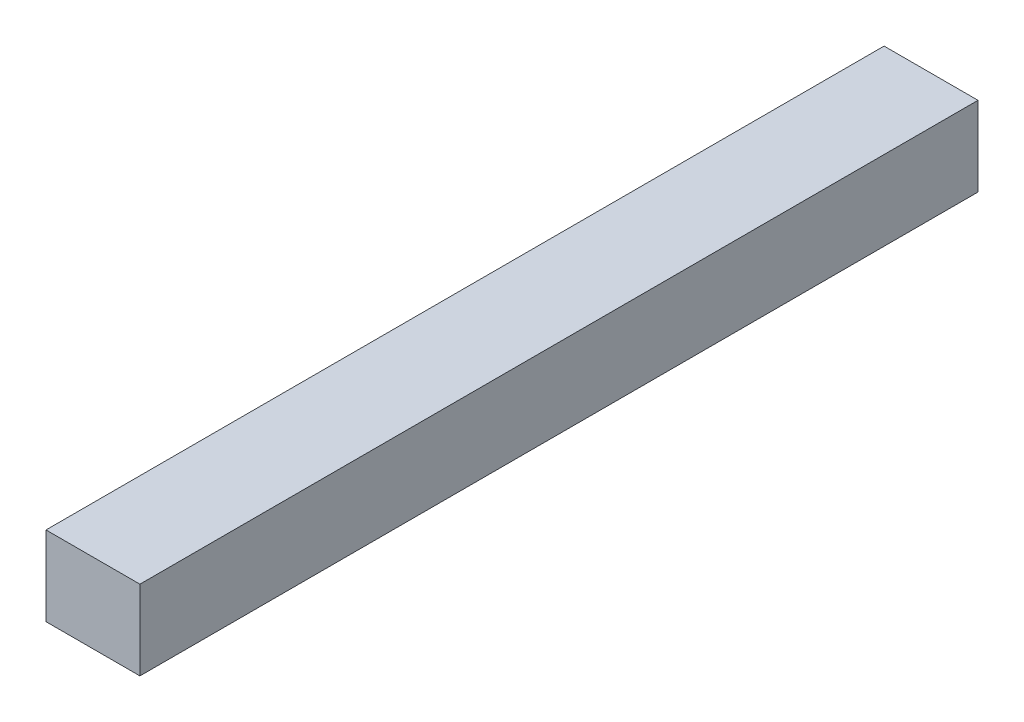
ISO-10303-21;
HEADER;
FILE_DESCRIPTION(('STEP AP214'),'2;1');
FILE_NAME('part.step','',(''),(''),'','','');
FILE_SCHEMA(('AUTOMOTIVE_DESIGN { 1 0 10303 214 1 1 1 1 }'));
ENDSEC;
DATA;
#1=APPLICATION_CONTEXT('core data for automotive mechanical design processes');
#2=APPLICATION_PROTOCOL_DEFINITION('international standard','automotive_design',2000,#1);
#3=PRODUCT_CONTEXT('',#1,'mechanical');
#4=PRODUCT('Part','Part','',(#3));
#5=PRODUCT_RELATED_PRODUCT_CATEGORY('part','',(#4));
#6=PRODUCT_DEFINITION_FORMATION('','',#4);
#7=PRODUCT_DEFINITION_CONTEXT('part definition',#1,'design');
#8=PRODUCT_DEFINITION('design','',#6,#7);
#9=PRODUCT_DEFINITION_SHAPE('','',#8);
#10=(LENGTH_UNIT() NAMED_UNIT(*) SI_UNIT(.MILLI.,.METRE.));
#11=(NAMED_UNIT(*) PLANE_ANGLE_UNIT() SI_UNIT($,.RADIAN.));
#12=(NAMED_UNIT(*) SI_UNIT($,.STERADIAN.) SOLID_ANGLE_UNIT());
#13=UNCERTAINTY_MEASURE_WITH_UNIT(LENGTH_MEASURE(1.E-05),#10,'distance_accuracy_value','');
#14=(GEOMETRIC_REPRESENTATION_CONTEXT(3) GLOBAL_UNCERTAINTY_ASSIGNED_CONTEXT((#13)) GLOBAL_UNIT_ASSIGNED_CONTEXT((#10,
#11,#12)) REPRESENTATION_CONTEXT('',''));
#15=CARTESIAN_POINT('',(0.,0.,0.));
#16=DIRECTION('',(0.,0.,1.));
#17=DIRECTION('',(1.,0.,0.));
#18=AXIS2_PLACEMENT_3D('',#15,#16,#17);
#19=CARTESIAN_POINT('',(32.5,27.5,580.));
#20=DIRECTION('',(-1.,0.,0.));
#21=DIRECTION('',(0.,-1.,0.));
#22=AXIS2_PLACEMENT_3D('',#19,#20,#21);
#23=PLANE('',#22);
#24=DIRECTION('',(0.,1.,0.));
#25=VECTOR('',#24,1.);
#26=CARTESIAN_POINT('',(32.5,27.5,0.));
#27=LINE('',#26,#25);
#28=CARTESIAN_POINT('',(32.5,-27.5,0.));
#29=VERTEX_POINT('',#28);
#30=CARTESIAN_POINT('',(32.5,27.5,0.));
#31=VERTEX_POINT('',#30);
#32=EDGE_CURVE('E95',#29,#31,#27,.T.);
#33=ORIENTED_EDGE('',*,*,#32,.T.);
#34=DIRECTION('',(0.,0.,-1.));
#35=VECTOR('',#34,1.);
#36=CARTESIAN_POINT('',(32.5,27.5,580.));
#37=LINE('',#36,#35);
#38=CARTESIAN_POINT('',(32.5,27.5,580.));
#39=VERTEX_POINT('',#38);
#40=EDGE_CURVE('E11',#39,#31,#37,.T.);
#41=ORIENTED_EDGE('',*,*,#40,.F.);
#42=DIRECTION('',(0.,1.,0.));
#43=VECTOR('',#42,1.);
#44=CARTESIAN_POINT('',(32.5,27.5,580.));
#45=LINE('',#44,#43);
#46=CARTESIAN_POINT('',(32.5,-27.5,580.));
#47=VERTEX_POINT('',#46);
#48=EDGE_CURVE('E83',#47,#39,#45,.T.);
#49=ORIENTED_EDGE('',*,*,#48,.F.);
#50=DIRECTION('',(0.,0.,-1.));
#51=VECTOR('',#50,1.);
#52=CARTESIAN_POINT('',(32.5,-27.5,580.));
#53=LINE('',#52,#51);
#54=EDGE_CURVE('E91',#47,#29,#53,.T.);
#55=ORIENTED_EDGE('',*,*,#54,.T.);
#56=EDGE_LOOP('',(#33,#41,#49,#55));
#57=FACE_BOUND('',#56,.T.);
#58=ADVANCED_FACE('F32',(#57),#23,.F.);
#59=CARTESIAN_POINT('',(-32.5,27.5,580.));
#60=DIRECTION('',(0.,-1.,0.));
#61=DIRECTION('',(0.,0.,-1.));
#62=AXIS2_PLACEMENT_3D('',#59,#60,#61);
#63=PLANE('',#62);
#64=DIRECTION('',(-1.,0.,0.));
#65=VECTOR('',#64,1.);
#66=CARTESIAN_POINT('',(-32.5,27.5,0.));
#67=LINE('',#66,#65);
#68=CARTESIAN_POINT('',(-32.5,27.5,0.));
#69=VERTEX_POINT('',#68);
#70=EDGE_CURVE('E87',#31,#69,#67,.T.);
#71=ORIENTED_EDGE('',*,*,#70,.T.);
#72=DIRECTION('',(0.,0.,-1.));
#73=VECTOR('',#72,1.);
#74=CARTESIAN_POINT('',(-32.5,27.5,580.));
#75=LINE('',#74,#73);
#76=CARTESIAN_POINT('',(-32.5,27.5,580.));
#77=VERTEX_POINT('',#76);
#78=EDGE_CURVE('E40',#77,#69,#75,.T.);
#79=ORIENTED_EDGE('',*,*,#78,.F.);
#80=DIRECTION('',(-1.,0.,0.));
#81=VECTOR('',#80,1.);
#82=CARTESIAN_POINT('',(-32.5,27.5,580.));
#83=LINE('',#82,#81);
#84=EDGE_CURVE('E78',#39,#77,#83,.T.);
#85=ORIENTED_EDGE('',*,*,#84,.F.);
#86=ORIENTED_EDGE('',*,*,#40,.T.);
#87=EDGE_LOOP('',(#71,#79,#85,#86));
#88=FACE_BOUND('',#87,.T.);
#89=ADVANCED_FACE('F86',(#88),#63,.F.);
#90=CARTESIAN_POINT('',(-32.5,27.5,580.));
#91=DIRECTION('',(1.,0.,0.));
#92=DIRECTION('',(0.,1.,0.));
#93=AXIS2_PLACEMENT_3D('',#90,#91,#92);
#94=PLANE('',#93);
#95=DIRECTION('',(0.,-1.,0.));
#96=VECTOR('',#95,1.);
#97=CARTESIAN_POINT('',(-32.5,27.5,0.));
#98=LINE('',#97,#96);
#99=CARTESIAN_POINT('',(-32.5,-27.5,0.));
#100=VERTEX_POINT('',#99);
#101=EDGE_CURVE('E65',#69,#100,#98,.T.);
#102=ORIENTED_EDGE('',*,*,#101,.T.);
#103=DIRECTION('',(0.,0.,-1.));
#104=VECTOR('',#103,1.);
#105=CARTESIAN_POINT('',(-32.5,-27.5,580.));
#106=LINE('',#105,#104);
#107=CARTESIAN_POINT('',(-32.5,-27.5,580.));
#108=VERTEX_POINT('',#107);
#109=EDGE_CURVE('E88',#108,#100,#106,.T.);
#110=ORIENTED_EDGE('',*,*,#109,.F.);
#111=DIRECTION('',(0.,-1.,0.));
#112=VECTOR('',#111,1.);
#113=CARTESIAN_POINT('',(-32.5,27.5,580.));
#114=LINE('',#113,#112);
#115=EDGE_CURVE('E81',#77,#108,#114,.T.);
#116=ORIENTED_EDGE('',*,*,#115,.F.);
#117=ORIENTED_EDGE('',*,*,#78,.T.);
#118=EDGE_LOOP('',(#102,#110,#116,#117));
#119=FACE_BOUND('',#118,.T.);
#120=ADVANCED_FACE('F89',(#119),#94,.F.);
#121=CARTESIAN_POINT('',(-32.5,-27.5,580.));
#122=DIRECTION('',(0.,1.,0.));
#123=DIRECTION('',(0.,0.,1.));
#124=AXIS2_PLACEMENT_3D('',#121,#122,#123);
#125=PLANE('',#124);
#126=DIRECTION('',(1.,0.,0.));
#127=VECTOR('',#126,1.);
#128=CARTESIAN_POINT('',(-32.5,-27.5,0.));
#129=LINE('',#128,#127);
#130=EDGE_CURVE('E71',#100,#29,#129,.T.);
#131=ORIENTED_EDGE('',*,*,#130,.T.);
#132=ORIENTED_EDGE('',*,*,#54,.F.);
#133=DIRECTION('',(1.,0.,0.));
#134=VECTOR('',#133,1.);
#135=CARTESIAN_POINT('',(-32.5,-27.5,580.));
#136=LINE('',#135,#134);
#137=EDGE_CURVE('E48',#108,#47,#136,.T.);
#138=ORIENTED_EDGE('',*,*,#137,.F.);
#139=ORIENTED_EDGE('',*,*,#109,.T.);
#140=EDGE_LOOP('',(#131,#132,#138,#139));
#141=FACE_BOUND('',#140,.T.);
#142=ADVANCED_FACE('F102',(#141),#125,.F.);
#143=CARTESIAN_POINT('',(0.,0.,580.));
#144=DIRECTION('',(0.,0.,1.));
#145=DIRECTION('',(1.,0.,0.));
#146=AXIS2_PLACEMENT_3D('',#143,#144,#145);
#147=PLANE('',#146);
#148=ORIENTED_EDGE('',*,*,#48,.T.);
#149=ORIENTED_EDGE('',*,*,#84,.T.);
#150=ORIENTED_EDGE('',*,*,#115,.T.);
#151=ORIENTED_EDGE('',*,*,#137,.T.);
#152=EDGE_LOOP('',(#148,#149,#150,#151));
#153=FACE_BOUND('',#152,.T.);
#154=ADVANCED_FACE('F79',(#153),#147,.T.);
#155=CARTESIAN_POINT('',(0.,0.,0.));
#156=DIRECTION('',(0.,0.,1.));
#157=DIRECTION('',(1.,0.,0.));
#158=AXIS2_PLACEMENT_3D('',#155,#156,#157);
#159=PLANE('',#158);
#160=ORIENTED_EDGE('',*,*,#32,.F.);
#161=ORIENTED_EDGE('',*,*,#130,.F.);
#162=ORIENTED_EDGE('',*,*,#101,.F.);
#163=ORIENTED_EDGE('',*,*,#70,.F.);
#164=EDGE_LOOP('',(#160,#161,#162,#163));
#165=FACE_BOUND('',#164,.T.);
#166=ADVANCED_FACE('F105',(#165),#159,.F.);
#167=CLOSED_SHELL('',(#58,#89,#120,#142,#154,#166));
#168=MANIFOLD_SOLID_BREP('B2',#167);
#169=ADVANCED_BREP_SHAPE_REPRESENTATION('',(#18,#168),#14);
#170=SHAPE_DEFINITION_REPRESENTATION(#9,#169);
ENDSEC;
END-ISO-10303-21;
